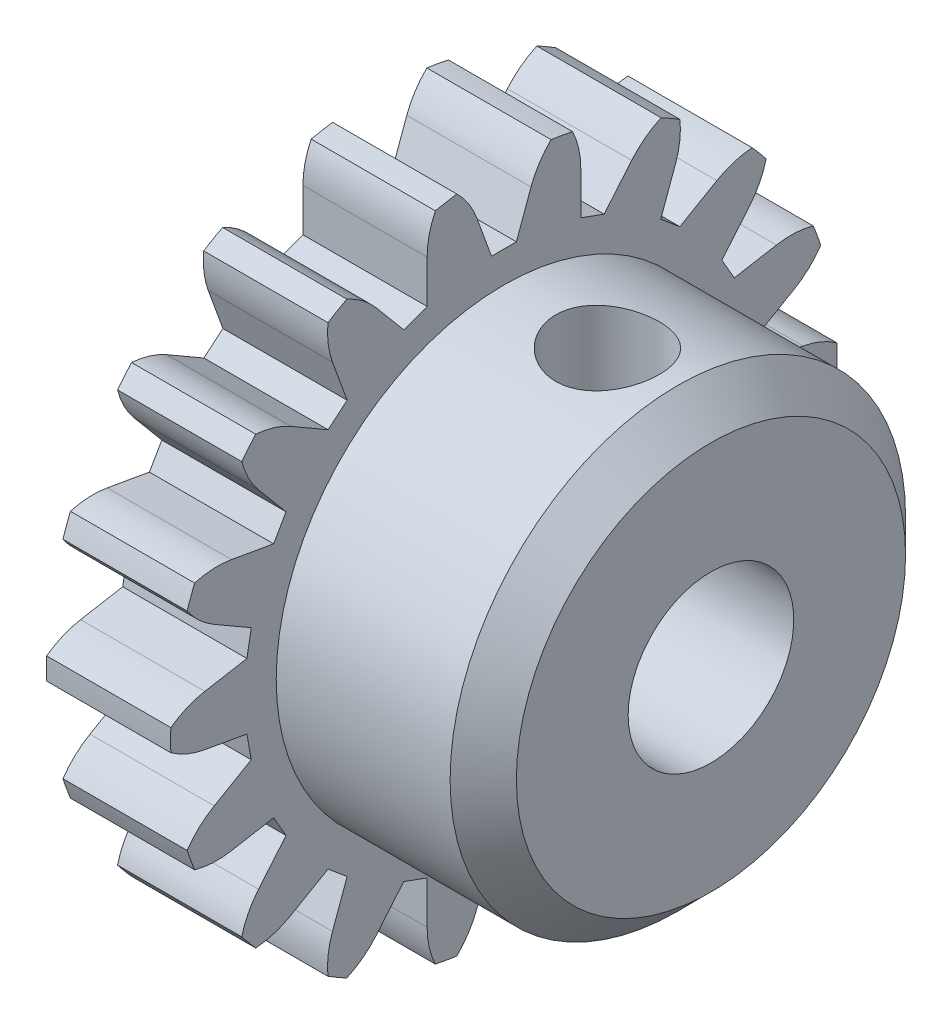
from build123d import *

# Parameters (mm, degrees)
ENL_V_MAT_EXTRU_1_DEPTH      = 14.914201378
R_P_TITION_CIRCULAIRE1_COUNT = 18
CHANFREIN1_SIZE              = 0.8
ESQUISSE3_R                  = 1.25
ENL_V_MAT_EXTRU_2_DEPTH      = 20


with BuildPart() as part:
    # Esquisse1 → R_volution1 (revolve)
    with BuildSketch(Plane.XY, mode=Mode.PRIVATE) as r_volution1_sk:
        Polygon((0, 2), (8, 2), (8, 5.5), (3, 5.5), (3, 8.05), (0, 8.05), align=None)
    revolve(r_volution1_sk.sketch.rotate(Axis((-19.448313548, 0, 0), (1, 0, 0)), 90), axis=Axis((-19.448313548, 0, 0), (1, 0, 0)))

    # Esquisse2 → Enl_v. mat.-Extru.1 (cut, through all)
    with BuildSketch(Plane.ZY):
        with BuildLine():
            Line((-2.533478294, 8.536396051), (2.532592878, 8.536470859))
            ThreePointArc((2.532592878, 8.536470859), (1.385457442, 8.174766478), (0.653237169, 7.220511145))
            Line((0.653237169, 7.220511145), (0.3, 6.25))
            Line((0.3, 6.25), (-0.300853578, 6.25))
            Line((-0.300853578, 6.25), (-0.65406352, 7.220436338))
            ThreePointArc((-0.65406352, 7.220436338), (-1.386307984, 8.17470861), (-2.533478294, 8.536396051))
        make_face()
    enl_v_mat_extru_1 = extrude(amount=-ENL_V_MAT_EXTRU_1_DEPTH, mode=Mode.SUBTRACT)

    # R_p_tition circulaire1: Enl_v. mat.-Extru.1 ×18 about axis
    r_p_tition_circulaire1_axis = Axis((0, 0, 0), (1, 0, 0))
    for i in range(1, R_P_TITION_CIRCULAIRE1_COUNT):
        add(enl_v_mat_extru_1.rotate(r_p_tition_circulaire1_axis, i * 360 / R_P_TITION_CIRCULAIRE1_COUNT), mode=Mode.SUBTRACT)

    # Chanfrein1
    chanfrein1_edges = [part.edges().sort_by_distance(p)[0] for p in [
        (8, 0, -5.5),
    ]]
    chamfer(chanfrein1_edges, length=CHANFREIN1_SIZE)

    # Esquisse3 → Enl_v. mat.-Extru.2 (cut)
    with BuildSketch(Plane(origin=(0, 0, 0), x_dir=(1, 0, 0), z_dir=(0, 1, 0))):
        with Locations(Location((5.5, 0, 0), (0, 0, 90))):
            Circle(ESQUISSE3_R)
    extrude(amount=ENL_V_MAT_EXTRU_2_DEPTH, mode=Mode.SUBTRACT)


solid = part.part
